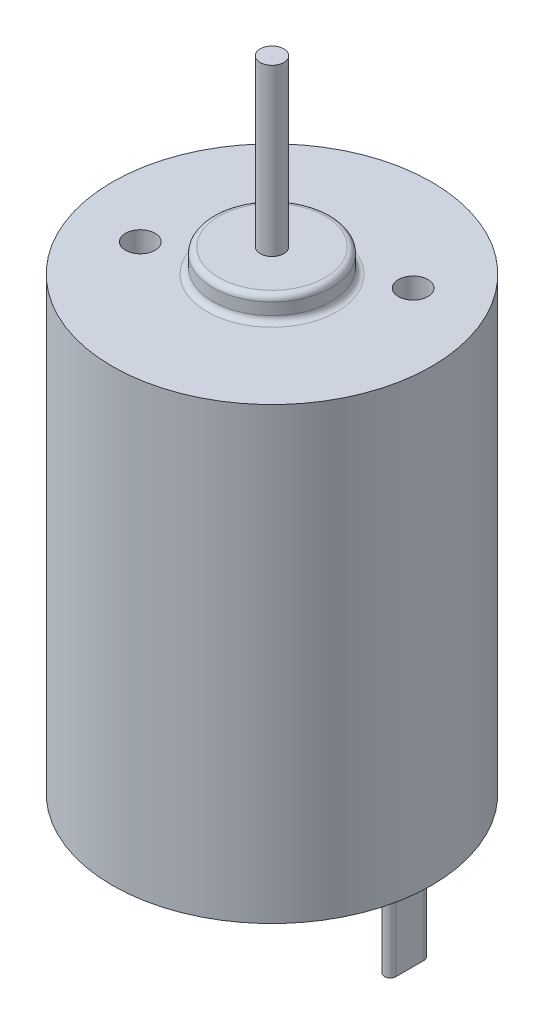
ISO-10303-21;
HEADER;
FILE_DESCRIPTION(('STEP AP214'),'2;1');
FILE_NAME('part.step','',(''),(''),'','','');
FILE_SCHEMA(('AUTOMOTIVE_DESIGN { 1 0 10303 214 1 1 1 1 }'));
ENDSEC;
DATA;
#1=APPLICATION_CONTEXT('core data for automotive mechanical design processes');
#2=APPLICATION_PROTOCOL_DEFINITION('international standard','automotive_design',2000,#1);
#3=PRODUCT_CONTEXT('',#1,'mechanical');
#4=PRODUCT('Part','Part','',(#3));
#5=PRODUCT_RELATED_PRODUCT_CATEGORY('part','',(#4));
#6=PRODUCT_DEFINITION_FORMATION('','',#4);
#7=PRODUCT_DEFINITION_CONTEXT('part definition',#1,'design');
#8=PRODUCT_DEFINITION('design','',#6,#7);
#9=PRODUCT_DEFINITION_SHAPE('','',#8);
#10=(LENGTH_UNIT() NAMED_UNIT(*) SI_UNIT(.MILLI.,.METRE.));
#11=(NAMED_UNIT(*) PLANE_ANGLE_UNIT() SI_UNIT($,.RADIAN.));
#12=(NAMED_UNIT(*) SI_UNIT($,.STERADIAN.) SOLID_ANGLE_UNIT());
#13=UNCERTAINTY_MEASURE_WITH_UNIT(LENGTH_MEASURE(1.E-05),#10,'distance_accuracy_value','');
#14=(GEOMETRIC_REPRESENTATION_CONTEXT(3) GLOBAL_UNCERTAINTY_ASSIGNED_CONTEXT((#13)) GLOBAL_UNIT_ASSIGNED_CONTEXT((#10,
#11,#12)) REPRESENTATION_CONTEXT('',''));
#15=CARTESIAN_POINT('',(0.,0.,0.));
#16=DIRECTION('',(0.,0.,1.));
#17=DIRECTION('',(1.,0.,0.));
#18=AXIS2_PLACEMENT_3D('',#15,#16,#17);
#19=CARTESIAN_POINT('',(5.,8.,0.));
#20=DIRECTION('',(0.,1.,0.));
#21=DIRECTION('',(-1.,0.,0.));
#22=AXIS2_PLACEMENT_3D('',#19,#20,#21);
#23=PLANE('',#22);
#24=CARTESIAN_POINT('',(0.,8.,0.));
#25=DIRECTION('',(0.,1.,0.));
#26=DIRECTION('',(-1.,0.,0.));
#27=AXIS2_PLACEMENT_3D('',#24,#25,#26);
#28=CIRCLE('',#27,5.5);
#29=CARTESIAN_POINT('',(-5.5,8.,0.));
#30=VERTEX_POINT('',#29);
#31=EDGE_CURVE('E11',#30,#30,#28,.T.);
#32=ORIENTED_EDGE('',*,*,#31,.T.);
#33=EDGE_LOOP('',(#32));
#34=FACE_BOUND('',#33,.T.);
#35=CARTESIAN_POINT('',(-11.180497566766,8.,1.1854581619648));
#36=DIRECTION('',(0.,-1.,0.));
#37=DIRECTION('',(-1.,0.,0.));
#38=AXIS2_PLACEMENT_3D('',#35,#36,#37);
#39=CIRCLE('',#38,0.488129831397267);
#40=CARTESIAN_POINT('',(-10.6923677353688,8.,1.1854581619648));
#41=VERTEX_POINT('',#40);
#42=CARTESIAN_POINT('',(-11.6686273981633,8.,1.1854581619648));
#43=VERTEX_POINT('',#42);
#44=EDGE_CURVE('E148',#41,#43,#39,.T.);
#45=ORIENTED_EDGE('',*,*,#44,.F.);
#46=DIRECTION('',(0.,0.,1.));
#47=VECTOR('',#46,1.);
#48=CARTESIAN_POINT('',(-10.6923677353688,8.,1.1854581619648));
#49=LINE('',#48,#47);
#50=CARTESIAN_POINT('',(-10.6923677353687,8.,-1.1854581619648));
#51=VERTEX_POINT('',#50);
#52=EDGE_CURVE('E174',#51,#41,#49,.T.);
#53=ORIENTED_EDGE('',*,*,#52,.F.);
#54=CARTESIAN_POINT('',(-11.180497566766,8.,-1.1854581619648));
#55=DIRECTION('',(0.,-1.,0.));
#56=DIRECTION('',(-1.,0.,0.));
#57=AXIS2_PLACEMENT_3D('',#54,#55,#56);
#58=CIRCLE('',#57,0.488129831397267);
#59=CARTESIAN_POINT('',(-11.6686273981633,8.,-1.1854581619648));
#60=VERTEX_POINT('',#59);
#61=EDGE_CURVE('E176',#60,#51,#58,.T.);
#62=ORIENTED_EDGE('',*,*,#61,.F.);
#63=DIRECTION('',(0.,0.,-1.));
#64=VECTOR('',#63,1.);
#65=CARTESIAN_POINT('',(-11.6686273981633,8.,1.1854581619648));
#66=LINE('',#65,#64);
#67=EDGE_CURVE('E182',#43,#60,#66,.T.);
#68=ORIENTED_EDGE('',*,*,#67,.F.);
#69=EDGE_LOOP('',(#45,#53,#62,#68));
#70=FACE_BOUND('',#69,.T.);
#71=CARTESIAN_POINT('',(0.,8.,0.));
#72=DIRECTION('',(0.,1.,0.));
#73=DIRECTION('',(-1.,0.,0.));
#74=AXIS2_PLACEMENT_3D('',#71,#72,#73);
#75=CIRCLE('',#74,13.5);
#76=CARTESIAN_POINT('',(-13.5,8.,0.));
#77=VERTEX_POINT('',#76);
#78=EDGE_CURVE('E203',#77,#77,#75,.T.);
#79=ORIENTED_EDGE('',*,*,#78,.F.);
#80=EDGE_LOOP('',(#79));
#81=FACE_BOUND('',#80,.T.);
#82=CARTESIAN_POINT('',(11.180497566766,8.,1.1854581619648));
#83=DIRECTION('',(0.,-1.,0.));
#84=DIRECTION('',(1.,0.,0.));
#85=AXIS2_PLACEMENT_3D('',#82,#83,#84);
#86=CIRCLE('',#85,0.488129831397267);
#87=CARTESIAN_POINT('',(11.6686273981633,8.,1.1854581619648));
#88=VERTEX_POINT('',#87);
#89=CARTESIAN_POINT('',(10.6923677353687,8.,1.1854581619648));
#90=VERTEX_POINT('',#89);
#91=EDGE_CURVE('E141',#88,#90,#86,.T.);
#92=ORIENTED_EDGE('',*,*,#91,.F.);
#93=DIRECTION('',(0.,0.,1.));
#94=VECTOR('',#93,1.);
#95=CARTESIAN_POINT('',(11.6686273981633,8.,1.1854581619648));
#96=LINE('',#95,#94);
#97=CARTESIAN_POINT('',(11.6686273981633,8.,-1.1854581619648));
#98=VERTEX_POINT('',#97);
#99=EDGE_CURVE('E139',#98,#88,#96,.T.);
#100=ORIENTED_EDGE('',*,*,#99,.F.);
#101=CARTESIAN_POINT('',(11.180497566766,8.,-1.1854581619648));
#102=DIRECTION('',(0.,-1.,0.));
#103=DIRECTION('',(1.,0.,0.));
#104=AXIS2_PLACEMENT_3D('',#101,#102,#103);
#105=CIRCLE('',#104,0.488129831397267);
#106=CARTESIAN_POINT('',(10.6923677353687,8.,-1.1854581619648));
#107=VERTEX_POINT('',#106);
#108=EDGE_CURVE('E63',#107,#98,#105,.T.);
#109=ORIENTED_EDGE('',*,*,#108,.F.);
#110=DIRECTION('',(0.,0.,-1.));
#111=VECTOR('',#110,1.);
#112=CARTESIAN_POINT('',(10.6923677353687,8.,1.1854581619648));
#113=LINE('',#112,#111);
#114=EDGE_CURVE('E59',#90,#107,#113,.T.);
#115=ORIENTED_EDGE('',*,*,#114,.F.);
#116=EDGE_LOOP('',(#92,#100,#109,#115));
#117=FACE_BOUND('',#116,.T.);
#118=ADVANCED_FACE('F43',(#34,#70,#81,#117),#23,.F.);
#119=CARTESIAN_POINT('',(0.,0.,0.));
#120=DIRECTION('',(0.,1.,0.));
#121=DIRECTION('',(-1.,0.,0.));
#122=AXIS2_PLACEMENT_3D('',#119,#120,#121);
#123=PLANE('',#122);
#124=CARTESIAN_POINT('',(0.,0.,0.));
#125=DIRECTION('',(0.,1.,0.));
#126=DIRECTION('',(-1.,0.,0.));
#127=AXIS2_PLACEMENT_3D('',#124,#125,#126);
#128=CIRCLE('',#127,1.);
#129=CARTESIAN_POINT('',(-1.,0.,0.));
#130=VERTEX_POINT('',#129);
#131=EDGE_CURVE('E210',#130,#130,#128,.T.);
#132=ORIENTED_EDGE('',*,*,#131,.F.);
#133=EDGE_LOOP('',(#132));
#134=FACE_BOUND('',#133,.T.);
#135=ADVANCED_FACE('F251',(#134),#123,.F.);
#136=CARTESIAN_POINT('',(0.,62.,0.));
#137=DIRECTION('',(0.,1.,0.));
#138=DIRECTION('',(-1.,0.,0.));
#139=AXIS2_PLACEMENT_3D('',#136,#137,#138);
#140=CYLINDRICAL_SURFACE('',#139,1.);
#141=CARTESIAN_POINT('',(0.,6.,0.));
#142=DIRECTION('',(0.,1.,0.));
#143=DIRECTION('',(-1.,0.,0.));
#144=AXIS2_PLACEMENT_3D('',#141,#142,#143);
#145=CIRCLE('',#144,1.);
#146=CARTESIAN_POINT('',(-1.,6.,0.));
#147=VERTEX_POINT('',#146);
#148=EDGE_CURVE('E204',#147,#147,#145,.T.);
#149=ORIENTED_EDGE('',*,*,#148,.F.);
#150=EDGE_LOOP('',(#149));
#151=FACE_BOUND('',#150,.T.);
#152=ORIENTED_EDGE('',*,*,#131,.T.);
#153=EDGE_LOOP('',(#152));
#154=FACE_BOUND('',#153,.T.);
#155=ADVANCED_FACE('F328',(#151,#154),#140,.T.);
#156=CARTESIAN_POINT('',(1.,6.,0.));
#157=DIRECTION('',(0.,1.,0.));
#158=DIRECTION('',(-1.,0.,0.));
#159=AXIS2_PLACEMENT_3D('',#156,#157,#158);
#160=PLANE('',#159);
#161=CARTESIAN_POINT('',(0.,6.,0.));
#162=DIRECTION('',(0.,1.,0.));
#163=DIRECTION('',(-1.,0.,0.));
#164=AXIS2_PLACEMENT_3D('',#161,#162,#163);
#165=CIRCLE('',#164,4.5);
#166=CARTESIAN_POINT('',(-4.5,6.,0.));
#167=VERTEX_POINT('',#166);
#168=EDGE_CURVE('E51',#167,#167,#165,.F.);
#169=ORIENTED_EDGE('',*,*,#168,.T.);
#170=EDGE_LOOP('',(#169));
#171=FACE_BOUND('',#170,.T.);
#172=ORIENTED_EDGE('',*,*,#148,.T.);
#173=EDGE_LOOP('',(#172));
#174=FACE_BOUND('',#173,.T.);
#175=ADVANCED_FACE('F226',(#171,#174),#160,.F.);
#176=CARTESIAN_POINT('',(0.,62.,0.));
#177=DIRECTION('',(0.,1.,0.));
#178=DIRECTION('',(-1.,0.,0.));
#179=AXIS2_PLACEMENT_3D('',#176,#177,#178);
#180=CYLINDRICAL_SURFACE('',#179,5.);
#181=CARTESIAN_POINT('',(0.,6.5,0.));
#182=DIRECTION('',(0.,1.,0.));
#183=DIRECTION('',(-1.,0.,0.));
#184=AXIS2_PLACEMENT_3D('',#181,#182,#183);
#185=CIRCLE('',#184,5.);
#186=CARTESIAN_POINT('',(-5.,6.5,0.));
#187=VERTEX_POINT('',#186);
#188=EDGE_CURVE('E223',#187,#187,#185,.T.);
#189=ORIENTED_EDGE('',*,*,#188,.T.);
#190=EDGE_LOOP('',(#189));
#191=FACE_BOUND('',#190,.T.);
#192=CARTESIAN_POINT('',(0.,7.5,0.));
#193=DIRECTION('',(0.,1.,0.));
#194=DIRECTION('',(-1.,0.,0.));
#195=AXIS2_PLACEMENT_3D('',#192,#193,#194);
#196=CIRCLE('',#195,5.);
#197=CARTESIAN_POINT('',(-5.,7.5,0.));
#198=VERTEX_POINT('',#197);
#199=EDGE_CURVE('E225',#198,#198,#196,.F.);
#200=ORIENTED_EDGE('',*,*,#199,.T.);
#201=EDGE_LOOP('',(#200));
#202=FACE_BOUND('',#201,.T.);
#203=ADVANCED_FACE('F239',(#191,#202),#180,.T.);
#204=CARTESIAN_POINT('',(0.,62.,0.));
#205=DIRECTION('',(0.,1.,0.));
#206=DIRECTION('',(-1.,0.,0.));
#207=AXIS2_PLACEMENT_3D('',#204,#205,#206);
#208=CYLINDRICAL_SURFACE('',#207,13.5);
#209=CARTESIAN_POINT('',(0.,46.,0.));
#210=DIRECTION('',(0.,1.,0.));
#211=DIRECTION('',(-1.,0.,0.));
#212=AXIS2_PLACEMENT_3D('',#209,#210,#211);
#213=CIRCLE('',#212,13.5);
#214=CARTESIAN_POINT('',(-13.5,46.,0.));
#215=VERTEX_POINT('',#214);
#216=EDGE_CURVE('E196',#215,#215,#213,.T.);
#217=ORIENTED_EDGE('',*,*,#216,.F.);
#218=EDGE_LOOP('',(#217));
#219=FACE_BOUND('',#218,.T.);
#220=ORIENTED_EDGE('',*,*,#78,.T.);
#221=EDGE_LOOP('',(#220));
#222=FACE_BOUND('',#221,.T.);
#223=ADVANCED_FACE('F245',(#219,#222),#208,.T.);
#224=CARTESIAN_POINT('',(13.5,46.,0.));
#225=DIRECTION('',(0.,-1.,0.));
#226=DIRECTION('',(1.,0.,0.));
#227=AXIS2_PLACEMENT_3D('',#224,#225,#226);
#228=PLANE('',#227);
#229=CARTESIAN_POINT('',(6.9818907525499,46.,-4.95007086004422));
#230=DIRECTION('',(0.,1.,0.));
#231=DIRECTION('',(0.,0.,1.));
#232=AXIS2_PLACEMENT_3D('',#229,#230,#231);
#233=CIRCLE('',#232,1.24999999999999);
#234=CARTESIAN_POINT('',(6.9818907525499,46.,-3.70007086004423));
#235=VERTEX_POINT('',#234);
#236=EDGE_CURVE('E124',#235,#235,#233,.T.);
#237=ORIENTED_EDGE('',*,*,#236,.F.);
#238=EDGE_LOOP('',(#237));
#239=FACE_BOUND('',#238,.T.);
#240=CARTESIAN_POINT('',(-7.94008082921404,46.,3.19454479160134));
#241=DIRECTION('',(0.,1.,0.));
#242=DIRECTION('',(0.,0.,1.));
#243=AXIS2_PLACEMENT_3D('',#240,#241,#242);
#244=CIRCLE('',#243,1.24999999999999);
#245=CARTESIAN_POINT('',(-7.94008082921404,46.,4.44454479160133));
#246=VERTEX_POINT('',#245);
#247=EDGE_CURVE('E116',#246,#246,#244,.T.);
#248=ORIENTED_EDGE('',*,*,#247,.F.);
#249=EDGE_LOOP('',(#248));
#250=FACE_BOUND('',#249,.T.);
#251=CARTESIAN_POINT('',(0.,46.,0.));
#252=DIRECTION('',(0.,-1.,0.));
#253=DIRECTION('',(1.,0.,0.));
#254=AXIS2_PLACEMENT_3D('',#251,#252,#253);
#255=CIRCLE('',#254,5.50000000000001);
#256=CARTESIAN_POINT('',(5.50000000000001,46.,0.));
#257=VERTEX_POINT('',#256);
#258=EDGE_CURVE('E218',#257,#257,#255,.T.);
#259=ORIENTED_EDGE('',*,*,#258,.T.);
#260=EDGE_LOOP('',(#259));
#261=FACE_BOUND('',#260,.T.);
#262=ORIENTED_EDGE('',*,*,#216,.T.);
#263=EDGE_LOOP('',(#262));
#264=FACE_BOUND('',#263,.T.);
#265=ADVANCED_FACE('F317',(#239,#250,#261,#264),#228,.F.);
#266=CARTESIAN_POINT('',(0.,62.,0.));
#267=DIRECTION('',(0.,1.,0.));
#268=DIRECTION('',(-1.,0.,0.));
#269=AXIS2_PLACEMENT_3D('',#266,#267,#268);
#270=CYLINDRICAL_SURFACE('',#269,5.00000000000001);
#271=CARTESIAN_POINT('',(0.,47.5,0.));
#272=DIRECTION('',(0.,-1.,0.));
#273=DIRECTION('',(1.,0.,0.));
#274=AXIS2_PLACEMENT_3D('',#271,#272,#273);
#275=CIRCLE('',#274,5.00000000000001);
#276=CARTESIAN_POINT('',(5.00000000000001,47.5,0.));
#277=VERTEX_POINT('',#276);
#278=EDGE_CURVE('E216',#277,#277,#275,.T.);
#279=ORIENTED_EDGE('',*,*,#278,.T.);
#280=EDGE_LOOP('',(#279));
#281=FACE_BOUND('',#280,.T.);
#282=CARTESIAN_POINT('',(0.,46.5,0.));
#283=DIRECTION('',(0.,-1.,0.));
#284=DIRECTION('',(1.,0.,0.));
#285=AXIS2_PLACEMENT_3D('',#282,#283,#284);
#286=CIRCLE('',#285,5.00000000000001);
#287=CARTESIAN_POINT('',(5.00000000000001,46.5,0.));
#288=VERTEX_POINT('',#287);
#289=EDGE_CURVE('E213',#288,#288,#286,.F.);
#290=ORIENTED_EDGE('',*,*,#289,.T.);
#291=EDGE_LOOP('',(#290));
#292=FACE_BOUND('',#291,.T.);
#293=ADVANCED_FACE('F312',(#281,#292),#270,.T.);
#294=CARTESIAN_POINT('',(5.00000000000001,48.,0.));
#295=DIRECTION('',(0.,-1.,0.));
#296=DIRECTION('',(1.,0.,0.));
#297=AXIS2_PLACEMENT_3D('',#294,#295,#296);
#298=PLANE('',#297);
#299=CARTESIAN_POINT('',(0.,48.,0.));
#300=DIRECTION('',(0.,-1.,0.));
#301=DIRECTION('',(1.,0.,0.));
#302=AXIS2_PLACEMENT_3D('',#299,#300,#301);
#303=CIRCLE('',#302,4.50000000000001);
#304=CARTESIAN_POINT('',(4.5,48.,0.));
#305=VERTEX_POINT('',#304);
#306=EDGE_CURVE('E209',#305,#305,#303,.F.);
#307=ORIENTED_EDGE('',*,*,#306,.T.);
#308=EDGE_LOOP('',(#307));
#309=FACE_BOUND('',#308,.T.);
#310=CARTESIAN_POINT('',(0.,48.,0.));
#311=DIRECTION('',(0.,1.,0.));
#312=DIRECTION('',(-1.,0.,0.));
#313=AXIS2_PLACEMENT_3D('',#310,#311,#312);
#314=CIRCLE('',#313,1.00000000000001);
#315=CARTESIAN_POINT('',(-1.00000000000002,48.,0.));
#316=VERTEX_POINT('',#315);
#317=EDGE_CURVE('E192',#316,#316,#314,.T.);
#318=ORIENTED_EDGE('',*,*,#317,.F.);
#319=EDGE_LOOP('',(#318));
#320=FACE_BOUND('',#319,.T.);
#321=ADVANCED_FACE('F313',(#309,#320),#298,.F.);
#322=CARTESIAN_POINT('',(0.,62.,0.));
#323=DIRECTION('',(0.,1.,0.));
#324=DIRECTION('',(-1.,0.,0.));
#325=AXIS2_PLACEMENT_3D('',#322,#323,#324);
#326=CYLINDRICAL_SURFACE('',#325,1.00000000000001);
#327=CARTESIAN_POINT('',(0.,62.,0.));
#328=DIRECTION('',(0.,1.,0.));
#329=DIRECTION('',(-1.,0.,0.));
#330=AXIS2_PLACEMENT_3D('',#327,#328,#329);
#331=CIRCLE('',#330,1.00000000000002);
#332=CARTESIAN_POINT('',(-1.00000000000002,62.,0.));
#333=VERTEX_POINT('',#332);
#334=EDGE_CURVE('E161',#333,#333,#331,.T.);
#335=ORIENTED_EDGE('',*,*,#334,.F.);
#336=EDGE_LOOP('',(#335));
#337=FACE_BOUND('',#336,.T.);
#338=ORIENTED_EDGE('',*,*,#317,.T.);
#339=EDGE_LOOP('',(#338));
#340=FACE_BOUND('',#339,.T.);
#341=ADVANCED_FACE('F307',(#337,#340),#326,.T.);
#342=CARTESIAN_POINT('',(1.00000000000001,62.,0.));
#343=DIRECTION('',(0.,-1.,0.));
#344=DIRECTION('',(1.,0.,0.));
#345=AXIS2_PLACEMENT_3D('',#342,#343,#344);
#346=PLANE('',#345);
#347=ORIENTED_EDGE('',*,*,#334,.T.);
#348=EDGE_LOOP('',(#347));
#349=FACE_BOUND('',#348,.T.);
#350=ADVANCED_FACE('F288',(#349),#346,.F.);
#351=CARTESIAN_POINT('',(-11.180497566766,0.999999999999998,1.1854581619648));
#352=DIRECTION('',(0.,1.,0.));
#353=DIRECTION('',(-1.,0.,0.));
#354=AXIS2_PLACEMENT_3D('',#351,#352,#353);
#355=CYLINDRICAL_SURFACE('',#354,0.488129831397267);
#356=ORIENTED_EDGE('',*,*,#44,.T.);
#357=DIRECTION('',(0.,1.,0.));
#358=VECTOR('',#357,1.);
#359=CARTESIAN_POINT('',(-11.6686273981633,0.999999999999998,1.1854581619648));
#360=LINE('',#359,#358);
#361=CARTESIAN_POINT('',(-11.6686273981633,0.999999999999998,1.1854581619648));
#362=VERTEX_POINT('',#361);
#363=EDGE_CURVE('E132',#362,#43,#360,.T.);
#364=ORIENTED_EDGE('',*,*,#363,.F.);
#365=CARTESIAN_POINT('',(-11.180497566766,0.999999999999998,1.1854581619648));
#366=DIRECTION('',(0.,-1.,0.));
#367=DIRECTION('',(-1.,0.,0.));
#368=AXIS2_PLACEMENT_3D('',#365,#366,#367);
#369=CIRCLE('',#368,0.488129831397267);
#370=CARTESIAN_POINT('',(-10.6923677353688,0.999999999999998,1.1854581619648));
#371=VERTEX_POINT('',#370);
#372=EDGE_CURVE('E180',#371,#362,#369,.T.);
#373=ORIENTED_EDGE('',*,*,#372,.F.);
#374=DIRECTION('',(0.,1.,0.));
#375=VECTOR('',#374,1.);
#376=CARTESIAN_POINT('',(-10.6923677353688,0.999999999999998,1.1854581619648));
#377=LINE('',#376,#375);
#378=EDGE_CURVE('E168',#371,#41,#377,.T.);
#379=ORIENTED_EDGE('',*,*,#378,.T.);
#380=EDGE_LOOP('',(#356,#364,#373,#379));
#381=FACE_BOUND('',#380,.T.);
#382=ADVANCED_FACE('F281',(#381),#355,.T.);
#383=CARTESIAN_POINT('',(-11.6686273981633,0.999999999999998,1.1854581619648));
#384=DIRECTION('',(1.,0.,0.));
#385=DIRECTION('',(0.,1.,0.));
#386=AXIS2_PLACEMENT_3D('',#383,#384,#385);
#387=PLANE('',#386);
#388=ORIENTED_EDGE('',*,*,#67,.T.);
#389=DIRECTION('',(0.,1.,0.));
#390=VECTOR('',#389,1.);
#391=CARTESIAN_POINT('',(-11.6686273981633,0.999999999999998,-1.1854581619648));
#392=LINE('',#391,#390);
#393=CARTESIAN_POINT('',(-11.6686273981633,0.999999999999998,-1.1854581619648));
#394=VERTEX_POINT('',#393);
#395=EDGE_CURVE('E163',#394,#60,#392,.T.);
#396=ORIENTED_EDGE('',*,*,#395,.F.);
#397=DIRECTION('',(0.,0.,-1.));
#398=VECTOR('',#397,1.);
#399=CARTESIAN_POINT('',(-11.6686273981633,0.999999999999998,1.1854581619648));
#400=LINE('',#399,#398);
#401=EDGE_CURVE('E189',#362,#394,#400,.T.);
#402=ORIENTED_EDGE('',*,*,#401,.F.);
#403=ORIENTED_EDGE('',*,*,#363,.T.);
#404=EDGE_LOOP('',(#388,#396,#402,#403));
#405=FACE_BOUND('',#404,.T.);
#406=ADVANCED_FACE('F290',(#405),#387,.F.);
#407=CARTESIAN_POINT('',(-11.180497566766,0.999999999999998,-1.1854581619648));
#408=DIRECTION('',(0.,1.,0.));
#409=DIRECTION('',(-1.,0.,0.));
#410=AXIS2_PLACEMENT_3D('',#407,#408,#409);
#411=CYLINDRICAL_SURFACE('',#410,0.488129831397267);
#412=ORIENTED_EDGE('',*,*,#61,.T.);
#413=DIRECTION('',(0.,1.,0.));
#414=VECTOR('',#413,1.);
#415=CARTESIAN_POINT('',(-10.6923677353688,0.999999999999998,-1.1854581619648));
#416=LINE('',#415,#414);
#417=CARTESIAN_POINT('',(-10.6923677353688,0.999999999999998,-1.1854581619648));
#418=VERTEX_POINT('',#417);
#419=EDGE_CURVE('E170',#418,#51,#416,.T.);
#420=ORIENTED_EDGE('',*,*,#419,.F.);
#421=CARTESIAN_POINT('',(-11.180497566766,0.999999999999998,-1.1854581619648));
#422=DIRECTION('',(0.,-1.,0.));
#423=DIRECTION('',(-1.,0.,0.));
#424=AXIS2_PLACEMENT_3D('',#421,#422,#423);
#425=CIRCLE('',#424,0.488129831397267);
#426=EDGE_CURVE('E190',#394,#418,#425,.T.);
#427=ORIENTED_EDGE('',*,*,#426,.F.);
#428=ORIENTED_EDGE('',*,*,#395,.T.);
#429=EDGE_LOOP('',(#412,#420,#427,#428));
#430=FACE_BOUND('',#429,.T.);
#431=ADVANCED_FACE('F291',(#430),#411,.T.);
#432=CARTESIAN_POINT('',(-10.6923677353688,0.999999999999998,1.1854581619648));
#433=DIRECTION('',(-1.,0.,0.));
#434=DIRECTION('',(0.,-1.,0.));
#435=AXIS2_PLACEMENT_3D('',#432,#433,#434);
#436=PLANE('',#435);
#437=ORIENTED_EDGE('',*,*,#52,.T.);
#438=ORIENTED_EDGE('',*,*,#378,.F.);
#439=DIRECTION('',(0.,0.,1.));
#440=VECTOR('',#439,1.);
#441=CARTESIAN_POINT('',(-10.6923677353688,0.999999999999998,1.1854581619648));
#442=LINE('',#441,#440);
#443=EDGE_CURVE('E173',#418,#371,#442,.T.);
#444=ORIENTED_EDGE('',*,*,#443,.F.);
#445=ORIENTED_EDGE('',*,*,#419,.T.);
#446=EDGE_LOOP('',(#437,#438,#444,#445));
#447=FACE_BOUND('',#446,.T.);
#448=ADVANCED_FACE('F300',(#447),#436,.F.);
#449=CARTESIAN_POINT('',(-11.180497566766,0.999999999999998,1.1854581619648));
#450=DIRECTION('',(0.,1.,0.));
#451=DIRECTION('',(-1.,0.,0.));
#452=AXIS2_PLACEMENT_3D('',#449,#450,#451);
#453=PLANE('',#452);
#454=ORIENTED_EDGE('',*,*,#372,.T.);
#455=ORIENTED_EDGE('',*,*,#401,.T.);
#456=ORIENTED_EDGE('',*,*,#426,.T.);
#457=ORIENTED_EDGE('',*,*,#443,.T.);
#458=EDGE_LOOP('',(#454,#455,#456,#457));
#459=FACE_BOUND('',#458,.T.);
#460=ADVANCED_FACE('F282',(#459),#453,.F.);
#461=CARTESIAN_POINT('',(11.180497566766,1.,1.1854581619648));
#462=DIRECTION('',(0.,1.,0.));
#463=DIRECTION('',(-1.,0.,0.));
#464=AXIS2_PLACEMENT_3D('',#461,#462,#463);
#465=CYLINDRICAL_SURFACE('',#464,0.488129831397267);
#466=ORIENTED_EDGE('',*,*,#91,.T.);
#467=DIRECTION('',(0.,1.,0.));
#468=VECTOR('',#467,1.);
#469=CARTESIAN_POINT('',(10.6923677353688,1.,1.1854581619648));
#470=LINE('',#469,#468);
#471=CARTESIAN_POINT('',(10.6923677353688,1.,1.1854581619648));
#472=VERTEX_POINT('',#471);
#473=EDGE_CURVE('E157',#472,#90,#470,.T.);
#474=ORIENTED_EDGE('',*,*,#473,.F.);
#475=CARTESIAN_POINT('',(11.180497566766,1.,1.1854581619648));
#476=DIRECTION('',(0.,-1.,0.));
#477=DIRECTION('',(1.,0.,0.));
#478=AXIS2_PLACEMENT_3D('',#475,#476,#477);
#479=CIRCLE('',#478,0.488129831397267);
#480=CARTESIAN_POINT('',(11.6686273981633,1.,1.1854581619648));
#481=VERTEX_POINT('',#480);
#482=EDGE_CURVE('E135',#481,#472,#479,.T.);
#483=ORIENTED_EDGE('',*,*,#482,.F.);
#484=DIRECTION('',(0.,1.,0.));
#485=VECTOR('',#484,1.);
#486=CARTESIAN_POINT('',(11.6686273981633,1.,1.1854581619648));
#487=LINE('',#486,#485);
#488=EDGE_CURVE('E142',#481,#88,#487,.T.);
#489=ORIENTED_EDGE('',*,*,#488,.T.);
#490=EDGE_LOOP('',(#466,#474,#483,#489));
#491=FACE_BOUND('',#490,.T.);
#492=ADVANCED_FACE('F264',(#491),#465,.T.);
#493=CARTESIAN_POINT('',(10.6923677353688,1.,1.1854581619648));
#494=DIRECTION('',(1.,0.,0.));
#495=DIRECTION('',(0.,1.,0.));
#496=AXIS2_PLACEMENT_3D('',#493,#494,#495);
#497=PLANE('',#496);
#498=ORIENTED_EDGE('',*,*,#114,.T.);
#499=DIRECTION('',(0.,1.,0.));
#500=VECTOR('',#499,1.);
#501=CARTESIAN_POINT('',(10.6923677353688,1.,-1.1854581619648));
#502=LINE('',#501,#500);
#503=CARTESIAN_POINT('',(10.6923677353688,1.,-1.1854581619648));
#504=VERTEX_POINT('',#503);
#505=EDGE_CURVE('E156',#504,#107,#502,.T.);
#506=ORIENTED_EDGE('',*,*,#505,.F.);
#507=DIRECTION('',(0.,0.,-1.));
#508=VECTOR('',#507,1.);
#509=CARTESIAN_POINT('',(10.6923677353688,1.,1.1854581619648));
#510=LINE('',#509,#508);
#511=EDGE_CURVE('E131',#472,#504,#510,.T.);
#512=ORIENTED_EDGE('',*,*,#511,.F.);
#513=ORIENTED_EDGE('',*,*,#473,.T.);
#514=EDGE_LOOP('',(#498,#506,#512,#513));
#515=FACE_BOUND('',#514,.T.);
#516=ADVANCED_FACE('F272',(#515),#497,.F.);
#517=CARTESIAN_POINT('',(11.180497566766,1.,-1.1854581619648));
#518=DIRECTION('',(0.,1.,0.));
#519=DIRECTION('',(-1.,0.,0.));
#520=AXIS2_PLACEMENT_3D('',#517,#518,#519);
#521=CYLINDRICAL_SURFACE('',#520,0.488129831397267);
#522=ORIENTED_EDGE('',*,*,#108,.T.);
#523=DIRECTION('',(0.,1.,0.));
#524=VECTOR('',#523,1.);
#525=CARTESIAN_POINT('',(11.6686273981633,1.,-1.1854581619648));
#526=LINE('',#525,#524);
#527=CARTESIAN_POINT('',(11.6686273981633,1.,-1.1854581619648));
#528=VERTEX_POINT('',#527);
#529=EDGE_CURVE('E153',#528,#98,#526,.T.);
#530=ORIENTED_EDGE('',*,*,#529,.F.);
#531=CARTESIAN_POINT('',(11.180497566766,1.,-1.1854581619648));
#532=DIRECTION('',(0.,-1.,0.));
#533=DIRECTION('',(1.,0.,0.));
#534=AXIS2_PLACEMENT_3D('',#531,#532,#533);
#535=CIRCLE('',#534,0.488129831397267);
#536=EDGE_CURVE('E140',#504,#528,#535,.T.);
#537=ORIENTED_EDGE('',*,*,#536,.F.);
#538=ORIENTED_EDGE('',*,*,#505,.T.);
#539=EDGE_LOOP('',(#522,#530,#537,#538));
#540=FACE_BOUND('',#539,.T.);
#541=ADVANCED_FACE('F271',(#540),#521,.T.);
#542=CARTESIAN_POINT('',(11.6686273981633,1.,1.1854581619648));
#543=DIRECTION('',(-1.,0.,0.));
#544=DIRECTION('',(0.,-1.,0.));
#545=AXIS2_PLACEMENT_3D('',#542,#543,#544);
#546=PLANE('',#545);
#547=ORIENTED_EDGE('',*,*,#99,.T.);
#548=ORIENTED_EDGE('',*,*,#488,.F.);
#549=DIRECTION('',(0.,0.,1.));
#550=VECTOR('',#549,1.);
#551=CARTESIAN_POINT('',(11.6686273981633,1.,1.1854581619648));
#552=LINE('',#551,#550);
#553=EDGE_CURVE('E137',#528,#481,#552,.T.);
#554=ORIENTED_EDGE('',*,*,#553,.F.);
#555=ORIENTED_EDGE('',*,*,#529,.T.);
#556=EDGE_LOOP('',(#547,#548,#554,#555));
#557=FACE_BOUND('',#556,.T.);
#558=ADVANCED_FACE('F261',(#557),#546,.F.);
#559=CARTESIAN_POINT('',(11.180497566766,1.,1.1854581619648));
#560=DIRECTION('',(0.,-1.,0.));
#561=DIRECTION('',(1.,0.,0.));
#562=AXIS2_PLACEMENT_3D('',#559,#560,#561);
#563=PLANE('',#562);
#564=ORIENTED_EDGE('',*,*,#482,.T.);
#565=ORIENTED_EDGE('',*,*,#511,.T.);
#566=ORIENTED_EDGE('',*,*,#536,.T.);
#567=ORIENTED_EDGE('',*,*,#553,.T.);
#568=EDGE_LOOP('',(#564,#565,#566,#567));
#569=FACE_BOUND('',#568,.T.);
#570=ADVANCED_FACE('F270',(#569),#563,.T.);
#571=CARTESIAN_POINT('',(0.,47.5,0.));
#572=DIRECTION('',(0.,-1.,0.));
#573=DIRECTION('',(1.,0.,0.));
#574=AXIS2_PLACEMENT_3D('',#571,#572,#573);
#575=TOROIDAL_SURFACE('',#574,4.50000000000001,0.5);
#576=ORIENTED_EDGE('',*,*,#278,.F.);
#577=EDGE_LOOP('',(#576));
#578=FACE_BOUND('',#577,.T.);
#579=ORIENTED_EDGE('',*,*,#306,.F.);
#580=EDGE_LOOP('',(#579));
#581=FACE_BOUND('',#580,.T.);
#582=ADVANCED_FACE('F337',(#578,#581),#575,.T.);
#583=CARTESIAN_POINT('',(0.,46.5,0.));
#584=DIRECTION('',(0.,-1.,0.));
#585=DIRECTION('',(1.,0.,0.));
#586=AXIS2_PLACEMENT_3D('',#583,#584,#585);
#587=TOROIDAL_SURFACE('',#586,5.50000000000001,0.5);
#588=ORIENTED_EDGE('',*,*,#258,.F.);
#589=EDGE_LOOP('',(#588));
#590=FACE_BOUND('',#589,.T.);
#591=ORIENTED_EDGE('',*,*,#289,.F.);
#592=EDGE_LOOP('',(#591));
#593=FACE_BOUND('',#592,.T.);
#594=ADVANCED_FACE('F237',(#590,#593),#587,.F.);
#595=CARTESIAN_POINT('',(0.,6.5,0.));
#596=DIRECTION('',(0.,1.,0.));
#597=DIRECTION('',(-1.,0.,0.));
#598=AXIS2_PLACEMENT_3D('',#595,#596,#597);
#599=TOROIDAL_SURFACE('',#598,4.5,0.5);
#600=ORIENTED_EDGE('',*,*,#168,.F.);
#601=EDGE_LOOP('',(#600));
#602=FACE_BOUND('',#601,.T.);
#603=ORIENTED_EDGE('',*,*,#188,.F.);
#604=EDGE_LOOP('',(#603));
#605=FACE_BOUND('',#604,.T.);
#606=ADVANCED_FACE('F235',(#602,#605),#599,.T.);
#607=CARTESIAN_POINT('',(0.,7.5,0.));
#608=DIRECTION('',(0.,1.,0.));
#609=DIRECTION('',(-1.,0.,0.));
#610=AXIS2_PLACEMENT_3D('',#607,#608,#609);
#611=TOROIDAL_SURFACE('',#610,5.5,0.5);
#612=ORIENTED_EDGE('',*,*,#199,.F.);
#613=EDGE_LOOP('',(#612));
#614=FACE_BOUND('',#613,.T.);
#615=ORIENTED_EDGE('',*,*,#31,.F.);
#616=EDGE_LOOP('',(#615));
#617=FACE_BOUND('',#616,.T.);
#618=ADVANCED_FACE('F44',(#614,#617),#611,.F.);
#619=CARTESIAN_POINT('',(-7.94008082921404,43.,3.19454479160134));
#620=DIRECTION('',(0.,1.,0.));
#621=DIRECTION('',(0.,0.,1.));
#622=AXIS2_PLACEMENT_3D('',#619,#620,#621);
#623=CONICAL_SURFACE('',#622,1.25,1.02974425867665);
#624=CARTESIAN_POINT('',(-7.94008082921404,42.2489242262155,3.19454479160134));
#625=VERTEX_POINT('',#624);
#626=VERTEX_LOOP('',#625);
#627=FACE_BOUND('',#626,.T.);
#628=CARTESIAN_POINT('',(-7.94008082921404,43.,3.19454479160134));
#629=DIRECTION('',(0.,1.,0.));
#630=DIRECTION('',(0.,0.,1.));
#631=AXIS2_PLACEMENT_3D('',#628,#629,#630);
#632=CIRCLE('',#631,1.25);
#633=CARTESIAN_POINT('',(-7.94008082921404,43.,4.44454479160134));
#634=VERTEX_POINT('',#633);
#635=EDGE_CURVE('E123',#634,#634,#632,.T.);
#636=ORIENTED_EDGE('',*,*,#635,.T.);
#637=EDGE_LOOP('',(#636));
#638=FACE_BOUND('',#637,.T.);
#639=ADVANCED_FACE('F250',(#627,#638),#623,.F.);
#640=CARTESIAN_POINT('',(-7.94008082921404,46.,3.19454479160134));
#641=DIRECTION('',(0.,1.,0.));
#642=DIRECTION('',(0.,0.,1.));
#643=AXIS2_PLACEMENT_3D('',#640,#641,#642);
#644=CYLINDRICAL_SURFACE('',#643,1.24999999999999);
#645=ORIENTED_EDGE('',*,*,#635,.F.);
#646=EDGE_LOOP('',(#645));
#647=FACE_BOUND('',#646,.T.);
#648=ORIENTED_EDGE('',*,*,#247,.T.);
#649=EDGE_LOOP('',(#648));
#650=FACE_BOUND('',#649,.T.);
#651=ADVANCED_FACE('F111',(#647,#650),#644,.F.);
#652=CARTESIAN_POINT('',(6.9818907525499,43.,-4.95007086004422));
#653=DIRECTION('',(0.,1.,0.));
#654=DIRECTION('',(0.,0.,1.));
#655=AXIS2_PLACEMENT_3D('',#652,#653,#654);
#656=CONICAL_SURFACE('',#655,1.25,1.02974425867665);
#657=CARTESIAN_POINT('',(6.9818907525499,42.2489242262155,-4.95007086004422));
#658=VERTEX_POINT('',#657);
#659=VERTEX_LOOP('',#658);
#660=FACE_BOUND('',#659,.T.);
#661=CARTESIAN_POINT('',(6.9818907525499,43.,-4.95007086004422));
#662=DIRECTION('',(0.,1.,0.));
#663=DIRECTION('',(0.,0.,1.));
#664=AXIS2_PLACEMENT_3D('',#661,#662,#663);
#665=CIRCLE('',#664,1.25);
#666=CARTESIAN_POINT('',(6.9818907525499,43.,-3.70007086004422));
#667=VERTEX_POINT('',#666);
#668=EDGE_CURVE('E118',#667,#667,#665,.T.);
#669=ORIENTED_EDGE('',*,*,#668,.T.);
#670=EDGE_LOOP('',(#669));
#671=FACE_BOUND('',#670,.T.);
#672=ADVANCED_FACE('F109',(#660,#671),#656,.F.);
#673=CARTESIAN_POINT('',(6.9818907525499,46.,-4.95007086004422));
#674=DIRECTION('',(0.,1.,0.));
#675=DIRECTION('',(0.,0.,1.));
#676=AXIS2_PLACEMENT_3D('',#673,#674,#675);
#677=CYLINDRICAL_SURFACE('',#676,1.24999999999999);
#678=ORIENTED_EDGE('',*,*,#668,.F.);
#679=EDGE_LOOP('',(#678));
#680=FACE_BOUND('',#679,.T.);
#681=ORIENTED_EDGE('',*,*,#236,.T.);
#682=EDGE_LOOP('',(#681));
#683=FACE_BOUND('',#682,.T.);
#684=ADVANCED_FACE('F114',(#680,#683),#677,.F.);
#685=CLOSED_SHELL('',(#118,#135,#155,#175,#203,#223,#265,#293,#321,#341,#350,#382,#406,#431,
#448,#460,#492,#516,#541,#558,#570,#582,#594,#606,#618,#639,#651,#672,#684));
#686=MANIFOLD_SOLID_BREP('B2',#685);
#687=ADVANCED_BREP_SHAPE_REPRESENTATION('',(#18,#686),#14);
#688=SHAPE_DEFINITION_REPRESENTATION(#9,#687);
ENDSEC;
END-ISO-10303-21;
